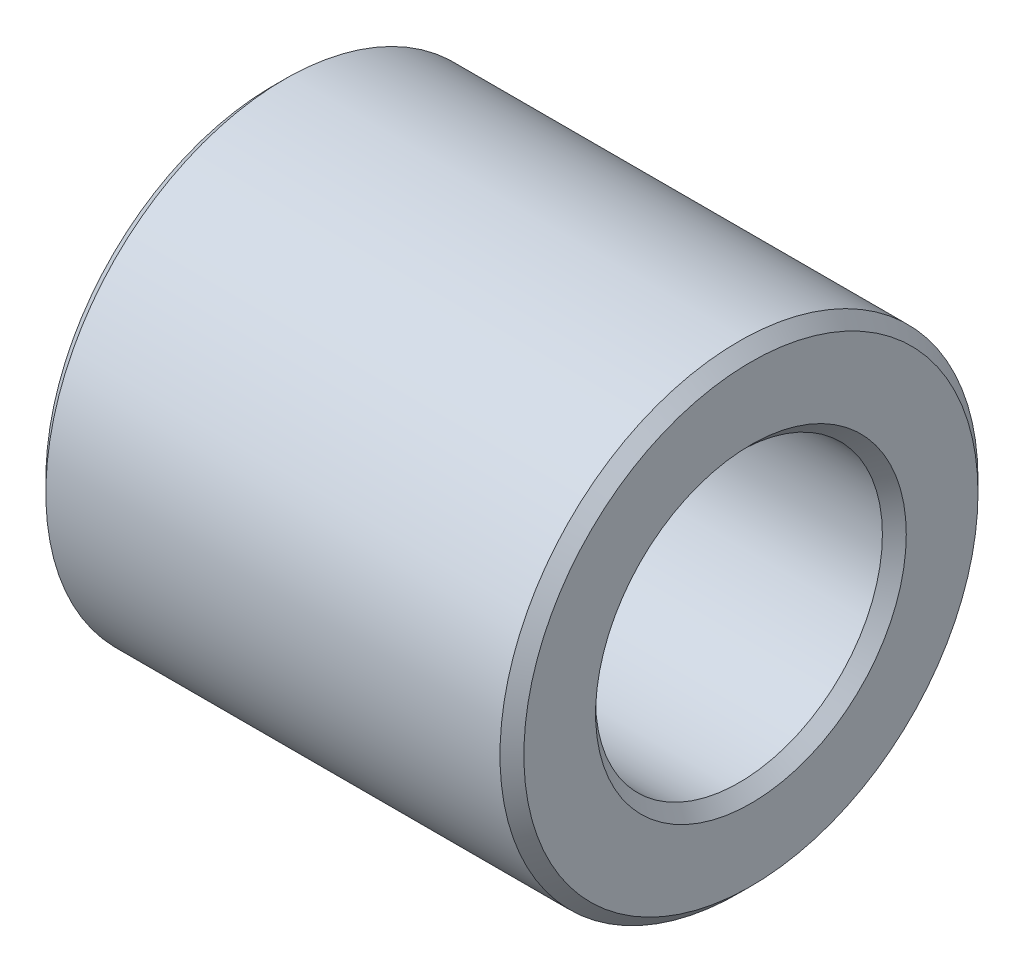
ISO-10303-21;
HEADER;
FILE_DESCRIPTION(('STEP AP214'),'2;1');
FILE_NAME('part.step','',(''),(''),'','','');
FILE_SCHEMA(('AUTOMOTIVE_DESIGN { 1 0 10303 214 1 1 1 1 }'));
ENDSEC;
DATA;
#1=APPLICATION_CONTEXT('core data for automotive mechanical design processes');
#2=APPLICATION_PROTOCOL_DEFINITION('international standard','automotive_design',2000,#1);
#3=PRODUCT_CONTEXT('',#1,'mechanical');
#4=PRODUCT('Part','Part','',(#3));
#5=PRODUCT_RELATED_PRODUCT_CATEGORY('part','',(#4));
#6=PRODUCT_DEFINITION_FORMATION('','',#4);
#7=PRODUCT_DEFINITION_CONTEXT('part definition',#1,'design');
#8=PRODUCT_DEFINITION('design','',#6,#7);
#9=PRODUCT_DEFINITION_SHAPE('','',#8);
#10=(LENGTH_UNIT() NAMED_UNIT(*) SI_UNIT(.MILLI.,.METRE.));
#11=(NAMED_UNIT(*) PLANE_ANGLE_UNIT() SI_UNIT($,.RADIAN.));
#12=(NAMED_UNIT(*) SI_UNIT($,.STERADIAN.) SOLID_ANGLE_UNIT());
#13=UNCERTAINTY_MEASURE_WITH_UNIT(LENGTH_MEASURE(1.E-05),#10,'distance_accuracy_value','');
#14=(GEOMETRIC_REPRESENTATION_CONTEXT(3) GLOBAL_UNCERTAINTY_ASSIGNED_CONTEXT((#13)) GLOBAL_UNIT_ASSIGNED_CONTEXT((#10,
#11,#12)) REPRESENTATION_CONTEXT('',''));
#15=CARTESIAN_POINT('',(0.,0.,0.));
#16=DIRECTION('',(0.,0.,1.));
#17=DIRECTION('',(1.,0.,0.));
#18=AXIS2_PLACEMENT_3D('',#15,#16,#17);
#19=CARTESIAN_POINT('',(10.,0.,0.));
#20=DIRECTION('',(1.,0.,0.));
#21=DIRECTION('',(0.,0.,-1.));
#22=AXIS2_PLACEMENT_3D('',#19,#20,#21);
#23=PLANE('',#22);
#24=CARTESIAN_POINT('',(10.,0.,0.));
#25=DIRECTION('',(1.,0.,0.));
#26=DIRECTION('',(0.,0.,-1.));
#27=AXIS2_PLACEMENT_3D('',#24,#25,#26);
#28=CIRCLE('',#27,3.25);
#29=CARTESIAN_POINT('',(10.,0.,-3.25));
#30=VERTEX_POINT('',#29);
#31=EDGE_CURVE('E40',#30,#30,#28,.F.);
#32=ORIENTED_EDGE('',*,*,#31,.T.);
#33=EDGE_LOOP('',(#32));
#34=FACE_BOUND('',#33,.T.);
#35=CARTESIAN_POINT('',(10.,0.,0.));
#36=DIRECTION('',(1.,0.,0.));
#37=DIRECTION('',(0.,0.,-1.));
#38=AXIS2_PLACEMENT_3D('',#35,#36,#37);
#39=CIRCLE('',#38,4.75);
#40=CARTESIAN_POINT('',(10.,0.,-4.75));
#41=VERTEX_POINT('',#40);
#42=EDGE_CURVE('E44',#41,#41,#39,.T.);
#43=ORIENTED_EDGE('',*,*,#42,.T.);
#44=EDGE_LOOP('',(#43));
#45=FACE_BOUND('',#44,.T.);
#46=ADVANCED_FACE('F29',(#34,#45),#23,.T.);
#47=CARTESIAN_POINT('',(0.,0.,0.));
#48=DIRECTION('',(1.,0.,0.));
#49=DIRECTION('',(0.,0.,-1.));
#50=AXIS2_PLACEMENT_3D('',#47,#48,#49);
#51=PLANE('',#50);
#52=CARTESIAN_POINT('',(0.,0.,0.));
#53=DIRECTION('',(1.,0.,0.));
#54=DIRECTION('',(0.,0.,-1.));
#55=AXIS2_PLACEMENT_3D('',#52,#53,#54);
#56=CIRCLE('',#55,3.25);
#57=CARTESIAN_POINT('',(0.,0.,-3.25));
#58=VERTEX_POINT('',#57);
#59=EDGE_CURVE('E55',#58,#58,#56,.T.);
#60=ORIENTED_EDGE('',*,*,#59,.T.);
#61=EDGE_LOOP('',(#60));
#62=FACE_BOUND('',#61,.T.);
#63=CARTESIAN_POINT('',(0.,0.,0.));
#64=DIRECTION('',(1.,0.,0.));
#65=DIRECTION('',(0.,0.,-1.));
#66=AXIS2_PLACEMENT_3D('',#63,#64,#65);
#67=CIRCLE('',#66,4.75);
#68=CARTESIAN_POINT('',(0.,0.,-4.75));
#69=VERTEX_POINT('',#68);
#70=EDGE_CURVE('E58',#69,#69,#67,.F.);
#71=ORIENTED_EDGE('',*,*,#70,.T.);
#72=EDGE_LOOP('',(#71));
#73=FACE_BOUND('',#72,.T.);
#74=ADVANCED_FACE('F62',(#62,#73),#51,.F.);
#75=CARTESIAN_POINT('',(10.,0.,0.));
#76=DIRECTION('',(-1.,0.,0.));
#77=DIRECTION('',(0.,0.,1.));
#78=AXIS2_PLACEMENT_3D('',#75,#76,#77);
#79=CYLINDRICAL_SURFACE('',#78,5.);
#80=CARTESIAN_POINT('',(0.25,0.,0.));
#81=DIRECTION('',(1.,0.,0.));
#82=DIRECTION('',(0.,0.,-1.));
#83=AXIS2_PLACEMENT_3D('',#80,#81,#82);
#84=CIRCLE('',#83,5.);
#85=CARTESIAN_POINT('',(0.25,0.,-5.));
#86=VERTEX_POINT('',#85);
#87=EDGE_CURVE('E10',#86,#86,#84,.T.);
#88=ORIENTED_EDGE('',*,*,#87,.T.);
#89=EDGE_LOOP('',(#88));
#90=FACE_BOUND('',#89,.T.);
#91=CARTESIAN_POINT('',(9.75,0.,0.));
#92=DIRECTION('',(1.,0.,0.));
#93=DIRECTION('',(0.,0.,-1.));
#94=AXIS2_PLACEMENT_3D('',#91,#92,#93);
#95=CIRCLE('',#94,5.);
#96=CARTESIAN_POINT('',(9.75,0.,-5.));
#97=VERTEX_POINT('',#96);
#98=EDGE_CURVE('E36',#97,#97,#95,.F.);
#99=ORIENTED_EDGE('',*,*,#98,.T.);
#100=EDGE_LOOP('',(#99));
#101=FACE_BOUND('',#100,.T.);
#102=ADVANCED_FACE('F82',(#90,#101),#79,.T.);
#103=CARTESIAN_POINT('',(10.,0.,0.));
#104=DIRECTION('',(-1.,0.,0.));
#105=DIRECTION('',(0.,0.,1.));
#106=AXIS2_PLACEMENT_3D('',#103,#104,#105);
#107=CYLINDRICAL_SURFACE('',#106,3.);
#108=CARTESIAN_POINT('',(0.25,0.,0.));
#109=DIRECTION('',(1.,0.,0.));
#110=DIRECTION('',(0.,0.,-1.));
#111=AXIS2_PLACEMENT_3D('',#108,#109,#110);
#112=CIRCLE('',#111,3.);
#113=CARTESIAN_POINT('',(0.25,0.,-3.));
#114=VERTEX_POINT('',#113);
#115=EDGE_CURVE('E49',#114,#114,#112,.F.);
#116=ORIENTED_EDGE('',*,*,#115,.T.);
#117=EDGE_LOOP('',(#116));
#118=FACE_BOUND('',#117,.T.);
#119=CARTESIAN_POINT('',(9.75,0.,0.));
#120=DIRECTION('',(1.,0.,0.));
#121=DIRECTION('',(0.,0.,-1.));
#122=AXIS2_PLACEMENT_3D('',#119,#120,#121);
#123=CIRCLE('',#122,3.);
#124=CARTESIAN_POINT('',(9.75,0.,-3.));
#125=VERTEX_POINT('',#124);
#126=EDGE_CURVE('E52',#125,#125,#123,.T.);
#127=ORIENTED_EDGE('',*,*,#126,.T.);
#128=EDGE_LOOP('',(#127));
#129=FACE_BOUND('',#128,.T.);
#130=ADVANCED_FACE('F87',(#118,#129),#107,.F.);
#131=CARTESIAN_POINT('',(0.,0.,0.));
#132=DIRECTION('',(-1.,0.,0.));
#133=DIRECTION('',(0.,0.,1.));
#134=AXIS2_PLACEMENT_3D('',#131,#132,#133);
#135=CONICAL_SURFACE('',#134,3.25,0.785398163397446);
#136=ORIENTED_EDGE('',*,*,#115,.F.);
#137=EDGE_LOOP('',(#136));
#138=FACE_BOUND('',#137,.T.);
#139=ORIENTED_EDGE('',*,*,#59,.F.);
#140=EDGE_LOOP('',(#139));
#141=FACE_BOUND('',#140,.T.);
#142=ADVANCED_FACE('F73',(#138,#141),#135,.F.);
#143=CARTESIAN_POINT('',(9.75,0.,0.));
#144=DIRECTION('',(1.,0.,0.));
#145=DIRECTION('',(0.,0.,-1.));
#146=AXIS2_PLACEMENT_3D('',#143,#144,#145);
#147=CONICAL_SURFACE('',#146,3.,0.785398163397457);
#148=ORIENTED_EDGE('',*,*,#31,.F.);
#149=EDGE_LOOP('',(#148));
#150=FACE_BOUND('',#149,.T.);
#151=ORIENTED_EDGE('',*,*,#126,.F.);
#152=EDGE_LOOP('',(#151));
#153=FACE_BOUND('',#152,.T.);
#154=ADVANCED_FACE('F67',(#150,#153),#147,.F.);
#155=CARTESIAN_POINT('',(0.25,0.,0.));
#156=DIRECTION('',(1.,0.,0.));
#157=DIRECTION('',(0.,0.,-1.));
#158=AXIS2_PLACEMENT_3D('',#155,#156,#157);
#159=CONICAL_SURFACE('',#158,5.,0.785398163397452);
#160=ORIENTED_EDGE('',*,*,#70,.F.);
#161=EDGE_LOOP('',(#160));
#162=FACE_BOUND('',#161,.T.);
#163=ORIENTED_EDGE('',*,*,#87,.F.);
#164=EDGE_LOOP('',(#163));
#165=FACE_BOUND('',#164,.T.);
#166=ADVANCED_FACE('F64',(#162,#165),#159,.T.);
#167=CARTESIAN_POINT('',(10.,0.,0.));
#168=DIRECTION('',(-1.,0.,0.));
#169=DIRECTION('',(0.,0.,1.));
#170=AXIS2_PLACEMENT_3D('',#167,#168,#169);
#171=CONICAL_SURFACE('',#170,4.75,0.785398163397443);
#172=ORIENTED_EDGE('',*,*,#98,.F.);
#173=EDGE_LOOP('',(#172));
#174=FACE_BOUND('',#173,.T.);
#175=ORIENTED_EDGE('',*,*,#42,.F.);
#176=EDGE_LOOP('',(#175));
#177=FACE_BOUND('',#176,.T.);
#178=ADVANCED_FACE('F31',(#174,#177),#171,.T.);
#179=CLOSED_SHELL('',(#46,#74,#102,#130,#142,#154,#166,#178));
#180=MANIFOLD_SOLID_BREP('B2',#179);
#181=ADVANCED_BREP_SHAPE_REPRESENTATION('',(#18,#180),#14);
#182=SHAPE_DEFINITION_REPRESENTATION(#9,#181);
ENDSEC;
END-ISO-10303-21;
